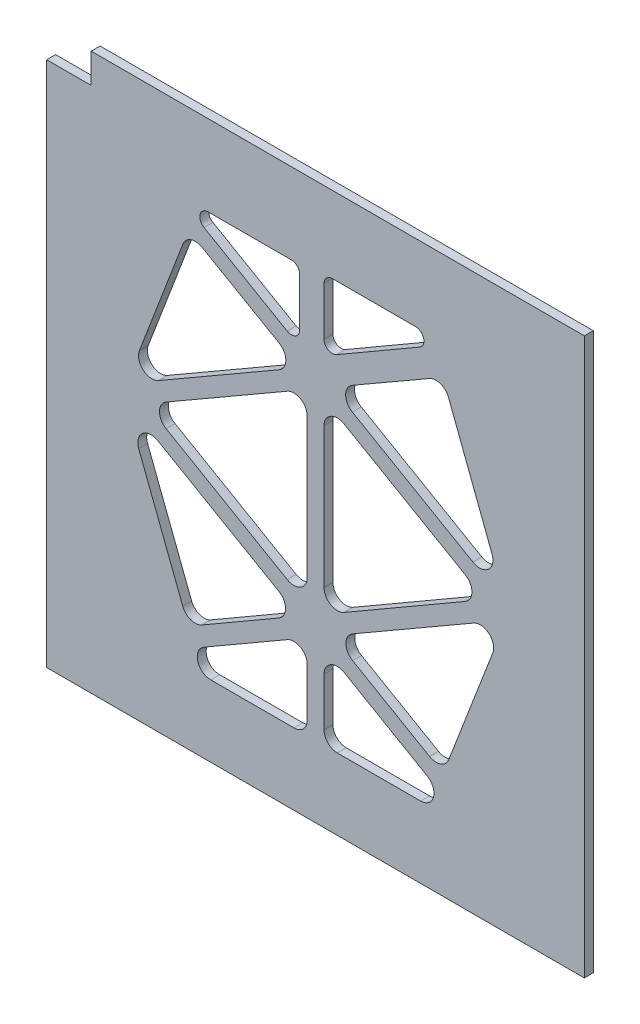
from build123d import *

# Parameters (mm, degrees)
BOSS_EXTRUDE1_DEPTH = 1.6
BOSS_EXTRUDE2_DEPTH = 0.9


with BuildPart() as part:
    # Model → Boss-Extrude1 (new body)
    with BuildSketch(Plane.XY):
        Polygon((43.3106, 178.8472), (43.3106, 173.5048), (35.313, 173.5048), (35.313, 82.4968), (35.313, 80.8328), (35.313, 78.828), (132.0026, 78.828), (132.0026, 178.8472), align=None)
        with BuildLine():
            Line((51.970050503, 136.526219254), (59.803495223, 157.041348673))
            ThreePointArc((59.803495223, 157.041348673), (61.241385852, 158.446472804), (63.243612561, 158.264837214))
            Line((63.243612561, 158.264837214), (77.107679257, 150.278119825))
            ThreePointArc((77.107679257, 150.278119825), (78.309671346, 148.199715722), (77.109768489, 146.120104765))
            Line((77.109768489, 146.120104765), (55.412257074, 133.591692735))
            ThreePointArc((55.412257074, 133.591692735), (52.655140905, 133.843710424), (51.970050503, 136.526219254))
        make_face(mode=Mode.SUBTRACT)
        with BuildLine():
            Line((104.132500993, 158.264837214), (90.268434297, 150.278119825))
            ThreePointArc((90.268434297, 150.278119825), (89.066442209, 148.199715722), (90.266345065, 146.120104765))
            Line((90.266345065, 146.120104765), (111.963856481, 133.591692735))
            ThreePointArc((111.963856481, 133.591692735), (114.720972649, 133.843710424), (115.406063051, 136.526219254))
            Line((115.406063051, 136.526219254), (107.572618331, 157.041348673))
            ThreePointArc((107.572618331, 157.041348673), (106.134727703, 158.446472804), (104.132500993, 158.264837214))
        make_face(mode=Mode.SUBTRACT)
        with BuildLine():
            Line((55.285610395, 124.156634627), (77.059566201, 111.584082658))
            ThreePointArc((77.059566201, 111.584082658), (78.259469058, 109.506882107), (77.061651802, 107.428478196))
            Line((77.061651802, 107.428478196), (63.213655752, 99.413928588))
            ThreePointArc((63.213655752, 99.413928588), (61.212641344, 99.227973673), (59.771729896, 100.62883487))
            Line((59.771729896, 100.62883487), (51.845770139, 121.215936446))
            ThreePointArc((51.845770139, 121.215936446), (52.525980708, 123.902471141), (55.285610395, 124.156634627))
        make_face(mode=Mode.SUBTRACT)
        with BuildLine():
            Line((82.1626, 94.0696), (82.1626, 102.731442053))
            ThreePointArc((82.1626, 102.731442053), (80.961818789, 104.810353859), (78.561038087, 104.809000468))
            Line((78.561038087, 104.809000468), (63.584296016, 96.147158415))
            ThreePointArc((63.584296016, 96.147158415), (62.467869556, 93.447563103), (64.785857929, 91.6696))
            Line((64.785857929, 91.6696), (79.7626, 91.6696))
            ThreePointArc((79.7626, 91.6696), (81.459656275, 92.372543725), (82.1626, 94.0696))
        make_face(mode=Mode.SUBTRACT)
        with BuildLine():
            Line((87.5818, 91.6696), (102.558052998, 91.6696))
            ThreePointArc((102.558052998, 91.6696), (104.875789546, 93.446625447), (103.761295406, 96.146185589))
            Line((103.761295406, 96.146185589), (88.785042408, 104.823922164))
            ThreePointArc((88.785042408, 104.823922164), (86.383422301, 104.826733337), (85.1818, 102.747336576))
            Line((85.1818, 102.747336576), (85.1818, 94.0696))
            ThreePointArc((85.1818, 94.0696), (85.884743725, 92.372543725), (87.5818, 91.6696))
        make_face(mode=Mode.SUBTRACT)
        with BuildLine():
            Line((85.1818, 163.6072), (85.1818, 154.929463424))
            ThreePointArc((85.1818, 154.929463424), (85.932813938, 153.629840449), (87.433826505, 153.631597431))
            Line((87.433826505, 153.631597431), (102.410079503, 162.309334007))
            ThreePointArc((102.410079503, 162.309334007), (103.106638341, 163.996559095), (101.658052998, 165.1072))
            Line((101.658052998, 165.1072), (86.6818, 165.1072))
            ThreePointArc((86.6818, 165.1072), (85.621139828, 164.667860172), (85.1818, 163.6072))
        make_face(mode=Mode.SUBTRACT)
        with BuildLine():
            Line((79.312014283, 164.328115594), (64.335272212, 164.328115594))
            ThreePointArc((64.335272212, 164.328115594), (62.886529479, 163.216888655), (63.584296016, 161.529641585))
            Line((63.584296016, 161.529641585), (78.561038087, 152.867799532))
            ThreePointArc((78.561038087, 152.867799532), (80.061526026, 152.866953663), (80.812014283, 154.166273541))
            Line((80.812014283, 154.166273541), (80.812014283, 162.828115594))
            ThreePointArc((80.812014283, 162.828115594), (80.372674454, 163.888775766), (79.312014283, 164.328115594))
        make_face(mode=Mode.SUBTRACT)
        with BuildLine():
            Line((112.090503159, 124.156634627), (90.316547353, 111.584082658))
            ThreePointArc((90.316547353, 111.584082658), (89.116644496, 109.506882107), (90.314461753, 107.428478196))
            Line((90.314461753, 107.428478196), (104.162457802, 99.413928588))
            ThreePointArc((104.162457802, 99.413928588), (106.163472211, 99.227973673), (107.604383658, 100.62883487))
            Line((107.604383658, 100.62883487), (115.530343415, 121.215936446))
            ThreePointArc((115.530343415, 121.215936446), (114.850132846, 123.902471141), (112.090503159, 124.156634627))
        make_face(mode=Mode.SUBTRACT)
        with BuildLine():
            Line((56.788751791, 126.775694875), (78.560417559, 114.175308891))
            ThreePointArc((78.560417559, 114.175308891), (80.961508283, 114.173417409), (82.1626, 116.252508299))
            Line((82.1626, 116.252508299), (82.1626, 141.424123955))
            ThreePointArc((82.1626, 141.424123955), (80.962551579, 143.502612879), (78.562503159, 143.50252901))
            Line((78.562503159, 143.50252901), (56.790837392, 130.931299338))
            ThreePointArc((56.790837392, 130.931299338), (55.590934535, 128.854098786), (56.788751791, 126.775694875))
        make_face(mode=Mode.SUBTRACT)
        with BuildLine():
            Line((85.1818, 141.439829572), (85.1818, 116.236766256))
            ThreePointArc((85.1818, 116.236766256), (86.382891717, 114.157675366), (88.783982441, 114.159566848))
            Line((88.783982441, 114.159566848), (110.582848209, 126.775694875))
            ThreePointArc((110.582848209, 126.775694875), (111.780665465, 128.854098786), (110.580762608, 130.931299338))
            Line((110.580762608, 130.931299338), (88.781896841, 143.518234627))
            ThreePointArc((88.781896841, 143.518234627), (86.381848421, 143.518318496), (85.1818, 141.439829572))
        make_face(mode=Mode.SUBTRACT)
    extrude(amount=BOSS_EXTRUDE1_DEPTH)

    # Model_3 → Boss-Extrude2 (add)
    with BuildSketch(Plane.XY):
        Polygon((43.3106, 178.8472), (43.3106, 173.5048), (35.313, 173.5048), (35.313, 82.4968), (35.313, 80.8328), (35.313, 78.828), (132.0026, 78.828), (132.0026, 178.8472), align=None)
        with BuildLine():
            Line((51.970050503, 136.526219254), (59.803495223, 157.041348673))
            ThreePointArc((59.803495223, 157.041348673), (61.241385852, 158.446472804), (63.243612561, 158.264837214))
            Line((63.243612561, 158.264837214), (77.107679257, 150.278119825))
            ThreePointArc((77.107679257, 150.278119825), (78.309671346, 148.199715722), (77.109768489, 146.120104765))
            Line((77.109768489, 146.120104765), (55.412257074, 133.591692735))
            ThreePointArc((55.412257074, 133.591692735), (52.655140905, 133.843710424), (51.970050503, 136.526219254))
        make_face(mode=Mode.SUBTRACT)
        with BuildLine():
            Line((104.132500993, 158.264837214), (90.268434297, 150.278119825))
            ThreePointArc((90.268434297, 150.278119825), (89.066442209, 148.199715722), (90.266345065, 146.120104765))
            Line((90.266345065, 146.120104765), (111.963856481, 133.591692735))
            ThreePointArc((111.963856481, 133.591692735), (114.720972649, 133.843710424), (115.406063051, 136.526219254))
            Line((115.406063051, 136.526219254), (107.572618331, 157.041348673))
            ThreePointArc((107.572618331, 157.041348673), (106.134727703, 158.446472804), (104.132500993, 158.264837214))
        make_face(mode=Mode.SUBTRACT)
        with BuildLine():
            Line((55.285610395, 124.156634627), (77.059566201, 111.584082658))
            ThreePointArc((77.059566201, 111.584082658), (78.259469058, 109.506882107), (77.061651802, 107.428478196))
            Line((77.061651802, 107.428478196), (63.213655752, 99.413928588))
            ThreePointArc((63.213655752, 99.413928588), (61.212641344, 99.227973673), (59.771729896, 100.62883487))
            Line((59.771729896, 100.62883487), (51.845770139, 121.215936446))
            ThreePointArc((51.845770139, 121.215936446), (52.525980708, 123.902471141), (55.285610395, 124.156634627))
        make_face(mode=Mode.SUBTRACT)
        with BuildLine():
            Line((82.1626, 94.0696), (82.1626, 102.731442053))
            ThreePointArc((82.1626, 102.731442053), (80.961818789, 104.810353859), (78.561038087, 104.809000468))
            Line((78.561038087, 104.809000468), (63.584296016, 96.147158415))
            ThreePointArc((63.584296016, 96.147158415), (62.467869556, 93.447563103), (64.785857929, 91.6696))
            Line((64.785857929, 91.6696), (79.7626, 91.6696))
            ThreePointArc((79.7626, 91.6696), (81.459656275, 92.372543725), (82.1626, 94.0696))
        make_face(mode=Mode.SUBTRACT)
        with BuildLine():
            Line((87.5818, 91.6696), (102.558052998, 91.6696))
            ThreePointArc((102.558052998, 91.6696), (104.875789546, 93.446625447), (103.761295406, 96.146185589))
            Line((103.761295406, 96.146185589), (88.785042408, 104.823922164))
            ThreePointArc((88.785042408, 104.823922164), (86.383422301, 104.826733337), (85.1818, 102.747336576))
            Line((85.1818, 102.747336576), (85.1818, 94.0696))
            ThreePointArc((85.1818, 94.0696), (85.884743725, 92.372543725), (87.5818, 91.6696))
        make_face(mode=Mode.SUBTRACT)
        with BuildLine():
            Line((85.1818, 163.6072), (85.1818, 154.929463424))
            ThreePointArc((85.1818, 154.929463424), (85.932813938, 153.629840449), (87.433826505, 153.631597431))
            Line((87.433826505, 153.631597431), (102.410079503, 162.309334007))
            ThreePointArc((102.410079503, 162.309334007), (103.106638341, 163.996559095), (101.658052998, 165.1072))
            Line((101.658052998, 165.1072), (86.6818, 165.1072))
            ThreePointArc((86.6818, 165.1072), (85.621139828, 164.667860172), (85.1818, 163.6072))
        make_face(mode=Mode.SUBTRACT)
        with BuildLine():
            Line((79.312014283, 164.328115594), (64.335272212, 164.328115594))
            ThreePointArc((64.335272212, 164.328115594), (62.886529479, 163.216888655), (63.584296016, 161.529641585))
            Line((63.584296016, 161.529641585), (78.561038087, 152.867799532))
            ThreePointArc((78.561038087, 152.867799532), (80.061526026, 152.866953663), (80.812014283, 154.166273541))
            Line((80.812014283, 154.166273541), (80.812014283, 162.828115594))
            ThreePointArc((80.812014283, 162.828115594), (80.372674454, 163.888775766), (79.312014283, 164.328115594))
        make_face(mode=Mode.SUBTRACT)
        with BuildLine():
            Line((112.090503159, 124.156634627), (90.316547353, 111.584082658))
            ThreePointArc((90.316547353, 111.584082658), (89.116644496, 109.506882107), (90.314461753, 107.428478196))
            Line((90.314461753, 107.428478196), (104.162457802, 99.413928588))
            ThreePointArc((104.162457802, 99.413928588), (106.163472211, 99.227973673), (107.604383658, 100.62883487))
            Line((107.604383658, 100.62883487), (115.530343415, 121.215936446))
            ThreePointArc((115.530343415, 121.215936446), (114.850132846, 123.902471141), (112.090503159, 124.156634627))
        make_face(mode=Mode.SUBTRACT)
        with BuildLine():
            Line((56.788751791, 126.775694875), (78.560417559, 114.175308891))
            ThreePointArc((78.560417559, 114.175308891), (80.961508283, 114.173417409), (82.1626, 116.252508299))
            Line((82.1626, 116.252508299), (82.1626, 141.424123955))
            ThreePointArc((82.1626, 141.424123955), (80.962551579, 143.502612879), (78.562503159, 143.50252901))
            Line((78.562503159, 143.50252901), (56.790837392, 130.931299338))
            ThreePointArc((56.790837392, 130.931299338), (55.590934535, 128.854098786), (56.788751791, 126.775694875))
        make_face(mode=Mode.SUBTRACT)
        with BuildLine():
            Line((85.1818, 141.439829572), (85.1818, 116.236766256))
            ThreePointArc((85.1818, 116.236766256), (86.382891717, 114.157675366), (88.783982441, 114.159566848))
            Line((88.783982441, 114.159566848), (110.582848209, 126.775694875))
            ThreePointArc((110.582848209, 126.775694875), (111.780665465, 128.854098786), (110.580762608, 130.931299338))
            Line((110.580762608, 130.931299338), (88.781896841, 143.518234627))
            ThreePointArc((88.781896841, 143.518234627), (86.381848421, 143.518318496), (85.1818, 141.439829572))
        make_face(mode=Mode.SUBTRACT)
    extrude(amount=BOSS_EXTRUDE2_DEPTH)


solid = part.part
